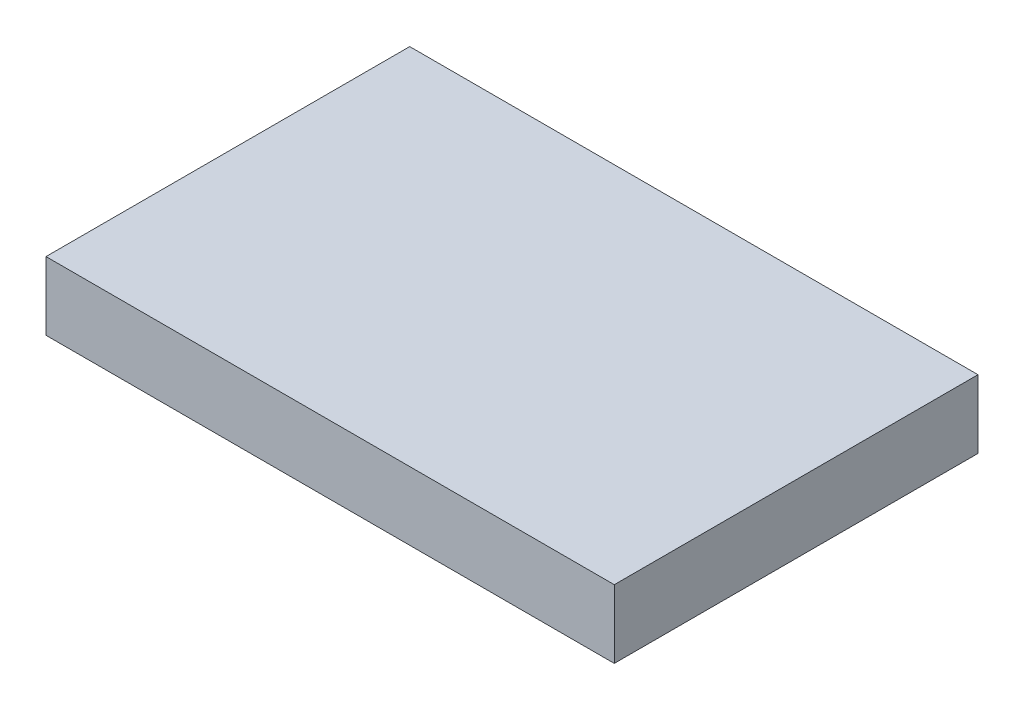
ISO-10303-21;
HEADER;
FILE_DESCRIPTION(('STEP AP214'),'2;1');
FILE_NAME('part.step','',(''),(''),'','','');
FILE_SCHEMA(('AUTOMOTIVE_DESIGN { 1 0 10303 214 1 1 1 1 }'));
ENDSEC;
DATA;
#1=APPLICATION_CONTEXT('core data for automotive mechanical design processes');
#2=APPLICATION_PROTOCOL_DEFINITION('international standard','automotive_design',2000,#1);
#3=PRODUCT_CONTEXT('',#1,'mechanical');
#4=PRODUCT('Part','Part','',(#3));
#5=PRODUCT_RELATED_PRODUCT_CATEGORY('part','',(#4));
#6=PRODUCT_DEFINITION_FORMATION('','',#4);
#7=PRODUCT_DEFINITION_CONTEXT('part definition',#1,'design');
#8=PRODUCT_DEFINITION('design','',#6,#7);
#9=PRODUCT_DEFINITION_SHAPE('','',#8);
#10=(LENGTH_UNIT() NAMED_UNIT(*) SI_UNIT(.MILLI.,.METRE.));
#11=(NAMED_UNIT(*) PLANE_ANGLE_UNIT() SI_UNIT($,.RADIAN.));
#12=(NAMED_UNIT(*) SI_UNIT($,.STERADIAN.) SOLID_ANGLE_UNIT());
#13=UNCERTAINTY_MEASURE_WITH_UNIT(LENGTH_MEASURE(1.E-05),#10,'distance_accuracy_value','');
#14=(GEOMETRIC_REPRESENTATION_CONTEXT(3) GLOBAL_UNCERTAINTY_ASSIGNED_CONTEXT((#13)) GLOBAL_UNIT_ASSIGNED_CONTEXT((#10,
#11,#12)) REPRESENTATION_CONTEXT('',''));
#15=CARTESIAN_POINT('',(0.,0.,0.));
#16=DIRECTION('',(0.,0.,1.));
#17=DIRECTION('',(1.,0.,0.));
#18=AXIS2_PLACEMENT_3D('',#15,#16,#17);
#19=CARTESIAN_POINT('',(12.5,3.,8.));
#20=DIRECTION('',(-1.,0.,0.));
#21=DIRECTION('',(0.,0.,1.));
#22=AXIS2_PLACEMENT_3D('',#19,#20,#21);
#23=PLANE('',#22);
#24=DIRECTION('',(0.,0.,-1.));
#25=VECTOR('',#24,1.);
#26=CARTESIAN_POINT('',(12.5,0.,8.));
#27=LINE('',#26,#25);
#28=CARTESIAN_POINT('',(12.5,0.,8.));
#29=VERTEX_POINT('',#28);
#30=CARTESIAN_POINT('',(12.5,0.,-8.));
#31=VERTEX_POINT('',#30);
#32=EDGE_CURVE('E116',#29,#31,#27,.T.);
#33=ORIENTED_EDGE('',*,*,#32,.T.);
#34=DIRECTION('',(0.,-1.,0.));
#35=VECTOR('',#34,1.);
#36=CARTESIAN_POINT('',(12.5,3.,-8.));
#37=LINE('',#36,#35);
#38=CARTESIAN_POINT('',(12.5,3.,-8.));
#39=VERTEX_POINT('',#38);
#40=EDGE_CURVE('E11',#39,#31,#37,.T.);
#41=ORIENTED_EDGE('',*,*,#40,.F.);
#42=DIRECTION('',(0.,0.,-1.));
#43=VECTOR('',#42,1.);
#44=CARTESIAN_POINT('',(12.5,3.,8.));
#45=LINE('',#44,#43);
#46=CARTESIAN_POINT('',(12.5,3.,8.));
#47=VERTEX_POINT('',#46);
#48=EDGE_CURVE('E100',#47,#39,#45,.T.);
#49=ORIENTED_EDGE('',*,*,#48,.F.);
#50=DIRECTION('',(0.,-1.,0.));
#51=VECTOR('',#50,1.);
#52=CARTESIAN_POINT('',(12.5,3.,8.));
#53=LINE('',#52,#51);
#54=EDGE_CURVE('E112',#47,#29,#53,.T.);
#55=ORIENTED_EDGE('',*,*,#54,.T.);
#56=EDGE_LOOP('',(#33,#41,#49,#55));
#57=FACE_BOUND('',#56,.T.);
#58=ADVANCED_FACE('F48',(#57),#23,.F.);
#59=CARTESIAN_POINT('',(-12.5,3.,-8.));
#60=DIRECTION('',(0.,0.,1.));
#61=DIRECTION('',(1.,0.,0.));
#62=AXIS2_PLACEMENT_3D('',#59,#60,#61);
#63=PLANE('',#62);
#64=DIRECTION('',(-1.,0.,0.));
#65=VECTOR('',#64,1.);
#66=CARTESIAN_POINT('',(-12.5,0.,-8.));
#67=LINE('',#66,#65);
#68=CARTESIAN_POINT('',(-12.5,0.,-8.));
#69=VERTEX_POINT('',#68);
#70=EDGE_CURVE('E105',#31,#69,#67,.T.);
#71=ORIENTED_EDGE('',*,*,#70,.T.);
#72=DIRECTION('',(0.,-1.,0.));
#73=VECTOR('',#72,1.);
#74=CARTESIAN_POINT('',(-12.5,3.,-8.));
#75=LINE('',#74,#73);
#76=CARTESIAN_POINT('',(-12.5,3.,-8.));
#77=VERTEX_POINT('',#76);
#78=EDGE_CURVE('E57',#77,#69,#75,.T.);
#79=ORIENTED_EDGE('',*,*,#78,.F.);
#80=DIRECTION('',(-1.,0.,0.));
#81=VECTOR('',#80,1.);
#82=CARTESIAN_POINT('',(-12.5,3.,-8.));
#83=LINE('',#82,#81);
#84=EDGE_CURVE('E95',#39,#77,#83,.T.);
#85=ORIENTED_EDGE('',*,*,#84,.F.);
#86=ORIENTED_EDGE('',*,*,#40,.T.);
#87=EDGE_LOOP('',(#71,#79,#85,#86));
#88=FACE_BOUND('',#87,.T.);
#89=ADVANCED_FACE('F104',(#88),#63,.F.);
#90=CARTESIAN_POINT('',(-12.5,3.,8.));
#91=DIRECTION('',(1.,0.,0.));
#92=DIRECTION('',(0.,0.,-1.));
#93=AXIS2_PLACEMENT_3D('',#90,#91,#92);
#94=PLANE('',#93);
#95=DIRECTION('',(0.,0.,1.));
#96=VECTOR('',#95,1.);
#97=CARTESIAN_POINT('',(-12.5,0.,8.));
#98=LINE('',#97,#96);
#99=CARTESIAN_POINT('',(-12.5,0.,8.));
#100=VERTEX_POINT('',#99);
#101=EDGE_CURVE('E82',#69,#100,#98,.T.);
#102=ORIENTED_EDGE('',*,*,#101,.T.);
#103=DIRECTION('',(0.,-1.,0.));
#104=VECTOR('',#103,1.);
#105=CARTESIAN_POINT('',(-12.5,3.,8.));
#106=LINE('',#105,#104);
#107=CARTESIAN_POINT('',(-12.5,3.,8.));
#108=VERTEX_POINT('',#107);
#109=EDGE_CURVE('E107',#108,#100,#106,.T.);
#110=ORIENTED_EDGE('',*,*,#109,.F.);
#111=DIRECTION('',(0.,0.,1.));
#112=VECTOR('',#111,1.);
#113=CARTESIAN_POINT('',(-12.5,3.,8.));
#114=LINE('',#113,#112);
#115=EDGE_CURVE('E98',#77,#108,#114,.T.);
#116=ORIENTED_EDGE('',*,*,#115,.F.);
#117=ORIENTED_EDGE('',*,*,#78,.T.);
#118=EDGE_LOOP('',(#102,#110,#116,#117));
#119=FACE_BOUND('',#118,.T.);
#120=ADVANCED_FACE('F108',(#119),#94,.F.);
#121=CARTESIAN_POINT('',(-12.5,3.,8.));
#122=DIRECTION('',(0.,0.,-1.));
#123=DIRECTION('',(-1.,0.,0.));
#124=AXIS2_PLACEMENT_3D('',#121,#122,#123);
#125=PLANE('',#124);
#126=DIRECTION('',(1.,0.,0.));
#127=VECTOR('',#126,1.);
#128=CARTESIAN_POINT('',(-12.5,0.,8.));
#129=LINE('',#128,#127);
#130=EDGE_CURVE('E88',#100,#29,#129,.T.);
#131=ORIENTED_EDGE('',*,*,#130,.T.);
#132=ORIENTED_EDGE('',*,*,#54,.F.);
#133=DIRECTION('',(1.,0.,0.));
#134=VECTOR('',#133,1.);
#135=CARTESIAN_POINT('',(-12.5,3.,8.));
#136=LINE('',#135,#134);
#137=EDGE_CURVE('E65',#108,#47,#136,.T.);
#138=ORIENTED_EDGE('',*,*,#137,.F.);
#139=ORIENTED_EDGE('',*,*,#109,.T.);
#140=EDGE_LOOP('',(#131,#132,#138,#139));
#141=FACE_BOUND('',#140,.T.);
#142=ADVANCED_FACE('F129',(#141),#125,.F.);
#143=CARTESIAN_POINT('',(0.,3.,0.));
#144=DIRECTION('',(0.,-1.,0.));
#145=DIRECTION('',(0.,0.,-1.));
#146=AXIS2_PLACEMENT_3D('',#143,#144,#145);
#147=PLANE('',#146);
#148=ORIENTED_EDGE('',*,*,#48,.T.);
#149=ORIENTED_EDGE('',*,*,#84,.T.);
#150=ORIENTED_EDGE('',*,*,#115,.T.);
#151=ORIENTED_EDGE('',*,*,#137,.T.);
#152=EDGE_LOOP('',(#148,#149,#150,#151));
#153=FACE_BOUND('',#152,.T.);
#154=ADVANCED_FACE('F96',(#153),#147,.F.);
#155=CARTESIAN_POINT('',(0.,0.,0.));
#156=DIRECTION('',(0.,-1.,0.));
#157=DIRECTION('',(0.,0.,-1.));
#158=AXIS2_PLACEMENT_3D('',#155,#156,#157);
#159=PLANE('',#158);
#160=ORIENTED_EDGE('',*,*,#32,.F.);
#161=ORIENTED_EDGE('',*,*,#130,.F.);
#162=ORIENTED_EDGE('',*,*,#101,.F.);
#163=ORIENTED_EDGE('',*,*,#70,.F.);
#164=EDGE_LOOP('',(#160,#161,#162,#163));
#165=FACE_BOUND('',#164,.T.);
#166=ADVANCED_FACE('F132',(#165),#159,.T.);
#167=CLOSED_SHELL('',(#58,#89,#120,#142,#154,#166));
#168=MANIFOLD_SOLID_BREP('B2',#167);
#169=ADVANCED_BREP_SHAPE_REPRESENTATION('',(#18,#168),#14);
#170=SHAPE_DEFINITION_REPRESENTATION(#9,#169);
ENDSEC;
END-ISO-10303-21;
